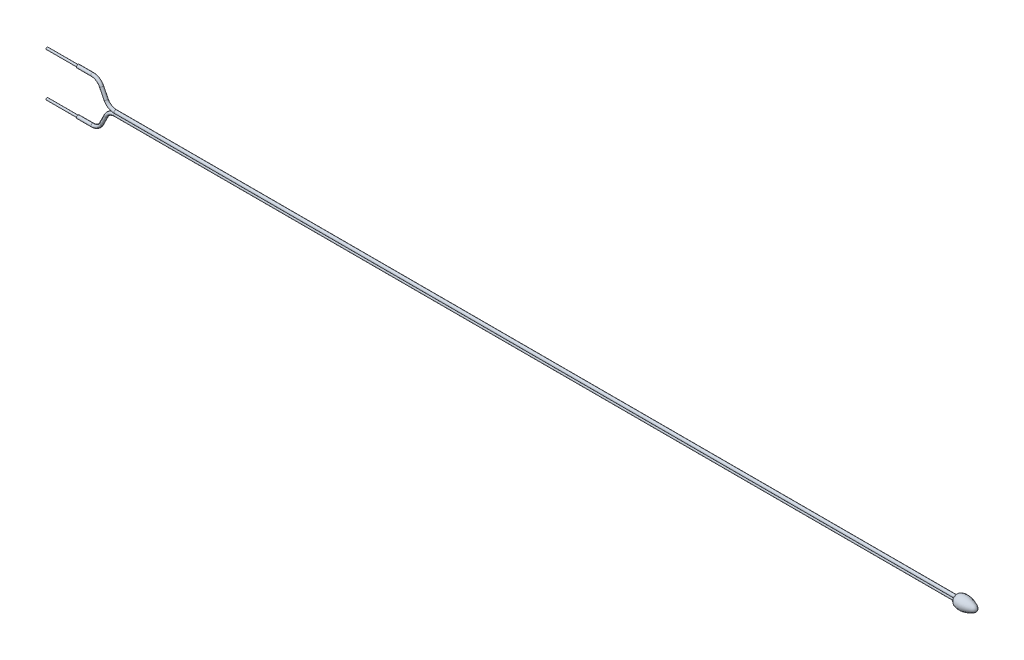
from build123d import *

# Parameters (mm, degrees)
SKETCH_3_R          = 0.15
SKETCH_4_R          = 0.223077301
SKETCH_4_R_2        = 0.1
CUT_EXTRUDE_1_DEPTH = 3


with BuildPart() as part:
    # Sketch 1 → Revolve 1 (revolve)
    with BuildSketch(Plane.XY):
        with BuildLine():
            Line((0, 0), (0, 0.3))
            add(Edge.make_bspline(
                [(0, 0.3), (0.11509679, 0.551800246), (0.767947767, 0.661200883), (1.447067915, 0.470950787), (1.985552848, 0.226242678), (2, 0)],
                knots=[0, 0, 0, 0, 0.344144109, 0.722890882, 1, 1, 1, 1], degree=3))
            Line((2, 0), (0, 0))
        make_face()
    revolve(axis=Axis((0, 0, 0), (1, 0, 0)))

    # Sweep 1: sweep along a path in Sketch 2
    with BuildLine(Plane.XY) as sweep_1_path:
        Line((0, 0.12), (-81.381966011, 0.12))
        ThreePointArc((-81.381966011, 0.12), (-81.907697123, 0.269349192), (-82.276393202, 0.672786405))
        Line((-82.276393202, 0.672786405), (-82.723606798, 1.567213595))
        ThreePointArc((-82.723606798, 1.567213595), (-83.092302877, 1.970650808), (-83.618033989, 2.12))
        Line((-83.618033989, 2.12), (-88, 2.12))
    # Sketch 3 → Sweep 1 (sweep)
    with BuildSketch(Plane.ZY):
        with Locations((0, 0.12)):
            Circle(SKETCH_3_R)
    sweep_1 = sweep(path=sweep_1_path.line)

    # Sketch 4 → Cut-Extrude 1 (cut)
    with BuildSketch(Plane.ZY.offset(88)):
        with Locations((0, 2.12)):
            Circle(SKETCH_4_R)
        with Locations((0, 2.12)):
            Circle(SKETCH_4_R_2, mode=Mode.SUBTRACT)
    cut_extrude_1 = extrude(amount=-CUT_EXTRUDE_1_DEPTH, mode=Mode.SUBTRACT)

    # Mirror 3: Sweep 1, Cut-Extrude 1 across plane
    add(sweep_1.mirror(Plane.ZX))
    add(cut_extrude_1.mirror(Plane.ZX), mode=Mode.SUBTRACT)


solid = part.part
